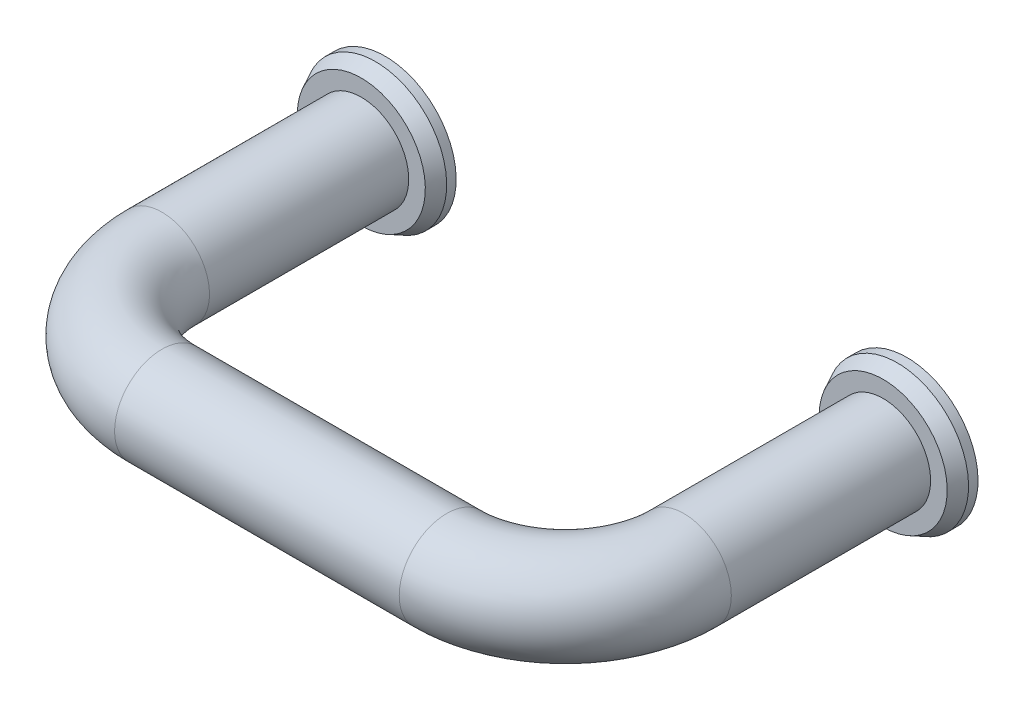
ISO-10303-21;
HEADER;
FILE_DESCRIPTION(('STEP AP214'),'2;1');
FILE_NAME('part.step','',(''),(''),'','','');
FILE_SCHEMA(('AUTOMOTIVE_DESIGN { 1 0 10303 214 1 1 1 1 }'));
ENDSEC;
DATA;
#1=APPLICATION_CONTEXT('core data for automotive mechanical design processes');
#2=APPLICATION_PROTOCOL_DEFINITION('international standard','automotive_design',2000,#1);
#3=PRODUCT_CONTEXT('',#1,'mechanical');
#4=PRODUCT('Part','Part','',(#3));
#5=PRODUCT_RELATED_PRODUCT_CATEGORY('part','',(#4));
#6=PRODUCT_DEFINITION_FORMATION('','',#4);
#7=PRODUCT_DEFINITION_CONTEXT('part definition',#1,'design');
#8=PRODUCT_DEFINITION('design','',#6,#7);
#9=PRODUCT_DEFINITION_SHAPE('','',#8);
#10=(LENGTH_UNIT() NAMED_UNIT(*) SI_UNIT(.MILLI.,.METRE.));
#11=(NAMED_UNIT(*) PLANE_ANGLE_UNIT() SI_UNIT($,.RADIAN.));
#12=(NAMED_UNIT(*) SI_UNIT($,.STERADIAN.) SOLID_ANGLE_UNIT());
#13=UNCERTAINTY_MEASURE_WITH_UNIT(LENGTH_MEASURE(1.E-05),#10,'distance_accuracy_value','');
#14=(GEOMETRIC_REPRESENTATION_CONTEXT(3) GLOBAL_UNCERTAINTY_ASSIGNED_CONTEXT((#13)) GLOBAL_UNIT_ASSIGNED_CONTEXT((#10,
#11,#12)) REPRESENTATION_CONTEXT('',''));
#15=CARTESIAN_POINT('',(0.,0.,0.));
#16=DIRECTION('',(0.,0.,1.));
#17=DIRECTION('',(1.,0.,0.));
#18=AXIS2_PLACEMENT_3D('',#15,#16,#17);
#19=CARTESIAN_POINT('',(0.,0.,0.));
#20=DIRECTION('',(0.,0.,-1.));
#21=DIRECTION('',(0.,1.,0.));
#22=AXIS2_PLACEMENT_3D('',#19,#20,#21);
#23=PLANE('',#22);
#24=CARTESIAN_POINT('',(0.,0.,0.));
#25=DIRECTION('',(0.,0.,1.));
#26=DIRECTION('',(0.,-1.,0.));
#27=AXIS2_PLACEMENT_3D('',#24,#25,#26);
#28=CIRCLE('',#27,7.5);
#29=CARTESIAN_POINT('',(0.,-7.5,0.));
#30=VERTEX_POINT('',#29);
#31=EDGE_CURVE('E56',#30,#30,#28,.T.);
#32=ORIENTED_EDGE('',*,*,#31,.F.);
#33=EDGE_LOOP('',(#32));
#34=FACE_BOUND('',#33,.T.);
#35=CARTESIAN_POINT('',(0.,0.,0.));
#36=DIRECTION('',(0.,0.,1.));
#37=DIRECTION('',(0.,-1.,0.));
#38=AXIS2_PLACEMENT_3D('',#35,#36,#37);
#39=CIRCLE('',#38,2.5);
#40=CARTESIAN_POINT('',(0.,-2.5,0.));
#41=VERTEX_POINT('',#40);
#42=EDGE_CURVE('E62',#41,#41,#39,.T.);
#43=ORIENTED_EDGE('',*,*,#42,.T.);
#44=EDGE_LOOP('',(#43));
#45=FACE_BOUND('',#44,.T.);
#46=ADVANCED_FACE('F12',(#34,#45),#23,.T.);
#47=CARTESIAN_POINT('',(0.,0.,23.5));
#48=DIRECTION('',(0.,0.,-1.));
#49=DIRECTION('',(-1.,0.,0.));
#50=AXIS2_PLACEMENT_3D('',#47,#48,#49);
#51=CYLINDRICAL_SURFACE('',#50,5.);
#52=CARTESIAN_POINT('',(0.,0.,23.5));
#53=DIRECTION('',(0.,0.,-1.));
#54=DIRECTION('',(0.,1.,0.));
#55=AXIS2_PLACEMENT_3D('',#52,#53,#54);
#56=CIRCLE('',#55,5.);
#57=CARTESIAN_POINT('',(-5.,0.,23.5));
#58=VERTEX_POINT('',#57);
#59=EDGE_CURVE('E20',#58,#58,#56,.T.);
#60=ORIENTED_EDGE('',*,*,#59,.T.);
#61=EDGE_LOOP('',(#60));
#62=FACE_BOUND('',#61,.T.);
#63=CARTESIAN_POINT('',(0.,0.,2.5));
#64=DIRECTION('',(0.,0.,-1.));
#65=DIRECTION('',(0.,-1.,0.));
#66=AXIS2_PLACEMENT_3D('',#63,#64,#65);
#67=CIRCLE('',#66,5.);
#68=CARTESIAN_POINT('',(0.,-5.,2.5));
#69=VERTEX_POINT('',#68);
#70=EDGE_CURVE('E16',#69,#69,#67,.F.);
#71=ORIENTED_EDGE('',*,*,#70,.T.);
#72=EDGE_LOOP('',(#71));
#73=FACE_BOUND('',#72,.T.);
#74=ADVANCED_FACE('F14',(#62,#73),#51,.T.);
#75=CARTESIAN_POINT('',(55.,0.,23.5));
#76=DIRECTION('',(0.,0.,-1.));
#77=DIRECTION('',(-1.,0.,0.));
#78=AXIS2_PLACEMENT_3D('',#75,#76,#77);
#79=CYLINDRICAL_SURFACE('',#78,5.);
#80=CARTESIAN_POINT('',(55.,0.,23.5));
#81=DIRECTION('',(0.,0.,1.));
#82=DIRECTION('',(0.,1.,0.));
#83=AXIS2_PLACEMENT_3D('',#80,#81,#82);
#84=CIRCLE('',#83,5.);
#85=CARTESIAN_POINT('',(60.,0.,23.5));
#86=VERTEX_POINT('',#85);
#87=EDGE_CURVE('E32',#86,#86,#84,.T.);
#88=ORIENTED_EDGE('',*,*,#87,.F.);
#89=EDGE_LOOP('',(#88));
#90=FACE_BOUND('',#89,.T.);
#91=CARTESIAN_POINT('',(55.,0.,2.5));
#92=DIRECTION('',(0.,0.,-1.));
#93=DIRECTION('',(0.,-1.,0.));
#94=AXIS2_PLACEMENT_3D('',#91,#92,#93);
#95=CIRCLE('',#94,5.);
#96=CARTESIAN_POINT('',(55.,-5.,2.5));
#97=VERTEX_POINT('',#96);
#98=EDGE_CURVE('E8',#97,#97,#95,.T.);
#99=ORIENTED_EDGE('',*,*,#98,.F.);
#100=EDGE_LOOP('',(#99));
#101=FACE_BOUND('',#100,.T.);
#102=ADVANCED_FACE('F91',(#90,#101),#79,.T.);
#103=CARTESIAN_POINT('',(12.5,0.,23.5));
#104=DIRECTION('',(0.,-1.,0.));
#105=DIRECTION('',(1.,0.,0.));
#106=AXIS2_PLACEMENT_3D('',#103,#104,#105);
#107=TOROIDAL_SURFACE('',#106,12.5,5.);
#108=CARTESIAN_POINT('',(12.5,0.,36.));
#109=DIRECTION('',(-1.,0.,0.));
#110=DIRECTION('',(0.,1.,0.));
#111=AXIS2_PLACEMENT_3D('',#108,#109,#110);
#112=CIRCLE('',#111,5.);
#113=CARTESIAN_POINT('',(12.5,0.,41.));
#114=VERTEX_POINT('',#113);
#115=EDGE_CURVE('E24',#114,#114,#112,.T.);
#116=CARTESIAN_POINT('',(12.5,0.,23.5));
#117=DIRECTION('',(0.,-1.,0.));
#118=DIRECTION('',(1.,0.,0.));
#119=AXIS2_PLACEMENT_3D('',#116,#117,#118);
#120=CIRCLE('',#119,17.5);
#121=EDGE_CURVE('',#114,#58,#120,.T.);
#122=ORIENTED_EDGE('',*,*,#115,.T.);
#123=ORIENTED_EDGE('',*,*,#59,.F.);
#124=ORIENTED_EDGE('',*,*,#121,.T.);
#125=ORIENTED_EDGE('',*,*,#121,.F.);
#126=EDGE_LOOP('',(#122,#124,#123,#125));
#127=FACE_BOUND('',#126,.T.);
#128=ADVANCED_FACE('F100',(#127),#107,.T.);
#129=CARTESIAN_POINT('',(42.5,0.,36.));
#130=DIRECTION('',(-1.,0.,0.));
#131=DIRECTION('',(0.,-1.,0.));
#132=AXIS2_PLACEMENT_3D('',#129,#130,#131);
#133=CYLINDRICAL_SURFACE('',#132,5.);
#134=CARTESIAN_POINT('',(42.5,0.,36.));
#135=DIRECTION('',(-1.,0.,0.));
#136=DIRECTION('',(0.,1.,0.));
#137=AXIS2_PLACEMENT_3D('',#134,#135,#136);
#138=CIRCLE('',#137,5.);
#139=CARTESIAN_POINT('',(42.5,0.,41.));
#140=VERTEX_POINT('',#139);
#141=EDGE_CURVE('E29',#140,#140,#138,.T.);
#142=ORIENTED_EDGE('',*,*,#141,.T.);
#143=EDGE_LOOP('',(#142));
#144=FACE_BOUND('',#143,.T.);
#145=ORIENTED_EDGE('',*,*,#115,.F.);
#146=EDGE_LOOP('',(#145));
#147=FACE_BOUND('',#146,.T.);
#148=ADVANCED_FACE('F106',(#144,#147),#133,.T.);
#149=CARTESIAN_POINT('',(42.5,0.,23.5));
#150=DIRECTION('',(0.,-1.,0.));
#151=DIRECTION('',(1.,0.,0.));
#152=AXIS2_PLACEMENT_3D('',#149,#150,#151);
#153=TOROIDAL_SURFACE('',#152,12.5,5.);
#154=CARTESIAN_POINT('',(42.5,0.,23.5));
#155=DIRECTION('',(0.,-1.,0.));
#156=DIRECTION('',(1.,0.,0.));
#157=AXIS2_PLACEMENT_3D('',#154,#155,#156);
#158=CIRCLE('',#157,17.5);
#159=EDGE_CURVE('',#86,#140,#158,.T.);
#160=ORIENTED_EDGE('',*,*,#87,.T.);
#161=ORIENTED_EDGE('',*,*,#141,.F.);
#162=ORIENTED_EDGE('',*,*,#159,.T.);
#163=ORIENTED_EDGE('',*,*,#159,.F.);
#164=EDGE_LOOP('',(#160,#162,#161,#163));
#165=FACE_BOUND('',#164,.T.);
#166=ADVANCED_FACE('F102',(#165),#153,.T.);
#167=CARTESIAN_POINT('',(55.,0.,2.5));
#168=DIRECTION('',(0.,0.,-1.));
#169=DIRECTION('',(0.,-1.,0.));
#170=AXIS2_PLACEMENT_3D('',#167,#168,#169);
#171=PLANE('',#170);
#172=CARTESIAN_POINT('',(55.,0.,2.5));
#173=DIRECTION('',(0.,0.,-1.));
#174=DIRECTION('',(0.,-1.,0.));
#175=AXIS2_PLACEMENT_3D('',#172,#173,#174);
#176=CIRCLE('',#175,6.75);
#177=CARTESIAN_POINT('',(55.,-6.75,2.5));
#178=VERTEX_POINT('',#177);
#179=EDGE_CURVE('E35',#178,#178,#176,.T.);
#180=ORIENTED_EDGE('',*,*,#179,.F.);
#181=EDGE_LOOP('',(#180));
#182=FACE_BOUND('',#181,.T.);
#183=ORIENTED_EDGE('',*,*,#98,.T.);
#184=EDGE_LOOP('',(#183));
#185=FACE_BOUND('',#184,.T.);
#186=ADVANCED_FACE('F105',(#182,#185),#171,.F.);
#187=CARTESIAN_POINT('',(55.,0.,2.5));
#188=DIRECTION('',(0.,0.,-1.));
#189=DIRECTION('',(0.,-1.,0.));
#190=AXIS2_PLACEMENT_3D('',#187,#188,#189);
#191=CONICAL_SURFACE('',#190,6.75,0.463647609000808);
#192=CARTESIAN_POINT('',(55.,0.,0.999999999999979));
#193=DIRECTION('',(0.,0.,-1.));
#194=DIRECTION('',(0.,-1.,0.));
#195=AXIS2_PLACEMENT_3D('',#192,#193,#194);
#196=CIRCLE('',#195,7.5);
#197=CARTESIAN_POINT('',(55.,-7.5,0.999999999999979));
#198=VERTEX_POINT('',#197);
#199=EDGE_CURVE('E38',#198,#198,#196,.T.);
#200=ORIENTED_EDGE('',*,*,#199,.F.);
#201=EDGE_LOOP('',(#200));
#202=FACE_BOUND('',#201,.T.);
#203=ORIENTED_EDGE('',*,*,#179,.T.);
#204=EDGE_LOOP('',(#203));
#205=FACE_BOUND('',#204,.T.);
#206=ADVANCED_FACE('F146',(#202,#205),#191,.T.);
#207=CARTESIAN_POINT('',(55.,0.,0.));
#208=DIRECTION('',(0.,0.,-1.));
#209=DIRECTION('',(0.,-1.,0.));
#210=AXIS2_PLACEMENT_3D('',#207,#208,#209);
#211=CYLINDRICAL_SURFACE('',#210,7.5);
#212=CARTESIAN_POINT('',(55.,0.,0.));
#213=DIRECTION('',(0.,0.,-1.));
#214=DIRECTION('',(0.,-1.,0.));
#215=AXIS2_PLACEMENT_3D('',#212,#213,#214);
#216=CIRCLE('',#215,7.5);
#217=CARTESIAN_POINT('',(55.,-7.5,0.));
#218=VERTEX_POINT('',#217);
#219=EDGE_CURVE('E41',#218,#218,#216,.T.);
#220=ORIENTED_EDGE('',*,*,#219,.F.);
#221=EDGE_LOOP('',(#220));
#222=FACE_BOUND('',#221,.T.);
#223=ORIENTED_EDGE('',*,*,#199,.T.);
#224=EDGE_LOOP('',(#223));
#225=FACE_BOUND('',#224,.T.);
#226=ADVANCED_FACE('F143',(#222,#225),#211,.T.);
#227=CARTESIAN_POINT('',(55.,0.,0.));
#228=DIRECTION('',(0.,0.,1.));
#229=DIRECTION('',(0.,1.,0.));
#230=AXIS2_PLACEMENT_3D('',#227,#228,#229);
#231=PLANE('',#230);
#232=CARTESIAN_POINT('',(55.,0.,0.));
#233=DIRECTION('',(0.,0.,-1.));
#234=DIRECTION('',(0.,-1.,0.));
#235=AXIS2_PLACEMENT_3D('',#232,#233,#234);
#236=CIRCLE('',#235,2.5);
#237=CARTESIAN_POINT('',(55.,-2.5,0.));
#238=VERTEX_POINT('',#237);
#239=EDGE_CURVE('E47',#238,#238,#236,.T.);
#240=ORIENTED_EDGE('',*,*,#239,.F.);
#241=EDGE_LOOP('',(#240));
#242=FACE_BOUND('',#241,.T.);
#243=ORIENTED_EDGE('',*,*,#219,.T.);
#244=EDGE_LOOP('',(#243));
#245=FACE_BOUND('',#244,.T.);
#246=ADVANCED_FACE('F96',(#242,#245),#231,.F.);
#247=CARTESIAN_POINT('',(55.,0.,11.));
#248=DIRECTION('',(0.,0.,-1.));
#249=DIRECTION('',(0.,-1.,0.));
#250=AXIS2_PLACEMENT_3D('',#247,#248,#249);
#251=CYLINDRICAL_SURFACE('',#250,2.5);
#252=CARTESIAN_POINT('',(55.,0.,11.));
#253=DIRECTION('',(0.,0.,-1.));
#254=DIRECTION('',(0.,-1.,0.));
#255=AXIS2_PLACEMENT_3D('',#252,#253,#254);
#256=CIRCLE('',#255,2.5);
#257=CARTESIAN_POINT('',(55.,-2.5,11.));
#258=VERTEX_POINT('',#257);
#259=EDGE_CURVE('E44',#258,#258,#256,.T.);
#260=ORIENTED_EDGE('',*,*,#259,.F.);
#261=EDGE_LOOP('',(#260));
#262=FACE_BOUND('',#261,.T.);
#263=ORIENTED_EDGE('',*,*,#239,.T.);
#264=EDGE_LOOP('',(#263));
#265=FACE_BOUND('',#264,.T.);
#266=ADVANCED_FACE('F127',(#262,#265),#251,.F.);
#267=CARTESIAN_POINT('',(55.,0.,11.));
#268=DIRECTION('',(0.,0.,-1.));
#269=DIRECTION('',(0.,-1.,0.));
#270=AXIS2_PLACEMENT_3D('',#267,#268,#269);
#271=PLANE('',#270);
#272=ORIENTED_EDGE('',*,*,#259,.T.);
#273=EDGE_LOOP('',(#272));
#274=FACE_BOUND('',#273,.T.);
#275=ADVANCED_FACE('F125',(#274),#271,.T.);
#276=CARTESIAN_POINT('',(0.,0.,2.5));
#277=DIRECTION('',(0.,0.,-1.));
#278=DIRECTION('',(0.,-1.,0.));
#279=AXIS2_PLACEMENT_3D('',#276,#277,#278);
#280=PLANE('',#279);
#281=ORIENTED_EDGE('',*,*,#70,.F.);
#282=EDGE_LOOP('',(#281));
#283=FACE_BOUND('',#282,.T.);
#284=CARTESIAN_POINT('',(0.,0.,2.5));
#285=DIRECTION('',(0.,0.,1.));
#286=DIRECTION('',(0.,-1.,0.));
#287=AXIS2_PLACEMENT_3D('',#284,#285,#286);
#288=CIRCLE('',#287,6.75);
#289=CARTESIAN_POINT('',(0.,-6.75,2.5));
#290=VERTEX_POINT('',#289);
#291=EDGE_CURVE('E50',#290,#290,#288,.T.);
#292=ORIENTED_EDGE('',*,*,#291,.T.);
#293=EDGE_LOOP('',(#292));
#294=FACE_BOUND('',#293,.T.);
#295=ADVANCED_FACE('F122',(#283,#294),#280,.F.);
#296=CARTESIAN_POINT('',(0.,0.,2.5));
#297=DIRECTION('',(0.,0.,-1.));
#298=DIRECTION('',(0.,-1.,0.));
#299=AXIS2_PLACEMENT_3D('',#296,#297,#298);
#300=CONICAL_SURFACE('',#299,6.75,0.463647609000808);
#301=CARTESIAN_POINT('',(0.,0.,1.));
#302=DIRECTION('',(0.,0.,1.));
#303=DIRECTION('',(0.,-1.,0.));
#304=AXIS2_PLACEMENT_3D('',#301,#302,#303);
#305=CIRCLE('',#304,7.5);
#306=CARTESIAN_POINT('',(0.,-7.5,1.));
#307=VERTEX_POINT('',#306);
#308=EDGE_CURVE('E53',#307,#307,#305,.T.);
#309=ORIENTED_EDGE('',*,*,#308,.T.);
#310=EDGE_LOOP('',(#309));
#311=FACE_BOUND('',#310,.T.);
#312=ORIENTED_EDGE('',*,*,#291,.F.);
#313=EDGE_LOOP('',(#312));
#314=FACE_BOUND('',#313,.T.);
#315=ADVANCED_FACE('F81',(#311,#314),#300,.T.);
#316=CARTESIAN_POINT('',(0.,0.,0.));
#317=DIRECTION('',(0.,0.,-1.));
#318=DIRECTION('',(0.,-1.,0.));
#319=AXIS2_PLACEMENT_3D('',#316,#317,#318);
#320=CYLINDRICAL_SURFACE('',#319,7.5);
#321=ORIENTED_EDGE('',*,*,#31,.T.);
#322=EDGE_LOOP('',(#321));
#323=FACE_BOUND('',#322,.T.);
#324=ORIENTED_EDGE('',*,*,#308,.F.);
#325=EDGE_LOOP('',(#324));
#326=FACE_BOUND('',#325,.T.);
#327=ADVANCED_FACE('F70',(#323,#326),#320,.T.);
#328=CARTESIAN_POINT('',(0.,0.,11.));
#329=DIRECTION('',(0.,0.,-1.));
#330=DIRECTION('',(0.,-1.,0.));
#331=AXIS2_PLACEMENT_3D('',#328,#329,#330);
#332=CYLINDRICAL_SURFACE('',#331,2.5);
#333=CARTESIAN_POINT('',(0.,0.,11.));
#334=DIRECTION('',(0.,0.,1.));
#335=DIRECTION('',(0.,-1.,0.));
#336=AXIS2_PLACEMENT_3D('',#333,#334,#335);
#337=CIRCLE('',#336,2.5);
#338=CARTESIAN_POINT('',(0.,-2.5,11.));
#339=VERTEX_POINT('',#338);
#340=EDGE_CURVE('E59',#339,#339,#337,.T.);
#341=ORIENTED_EDGE('',*,*,#340,.T.);
#342=EDGE_LOOP('',(#341));
#343=FACE_BOUND('',#342,.T.);
#344=ORIENTED_EDGE('',*,*,#42,.F.);
#345=EDGE_LOOP('',(#344));
#346=FACE_BOUND('',#345,.T.);
#347=ADVANCED_FACE('F67',(#343,#346),#332,.F.);
#348=CARTESIAN_POINT('',(0.,0.,11.));
#349=DIRECTION('',(0.,0.,-1.));
#350=DIRECTION('',(0.,-1.,0.));
#351=AXIS2_PLACEMENT_3D('',#348,#349,#350);
#352=PLANE('',#351);
#353=ORIENTED_EDGE('',*,*,#340,.F.);
#354=EDGE_LOOP('',(#353));
#355=FACE_BOUND('',#354,.T.);
#356=ADVANCED_FACE('F69',(#355),#352,.T.);
#357=CLOSED_SHELL('',(#46,#74,#102,#128,#148,#166,#186,#206,#226,#246,#266,#275,#295,#315,#327,
#347,#356));
#358=MANIFOLD_SOLID_BREP('B1',#357);
#359=ADVANCED_BREP_SHAPE_REPRESENTATION('',(#18,#358),#14);
#360=SHAPE_DEFINITION_REPRESENTATION(#9,#359);
ENDSEC;
END-ISO-10303-21;
